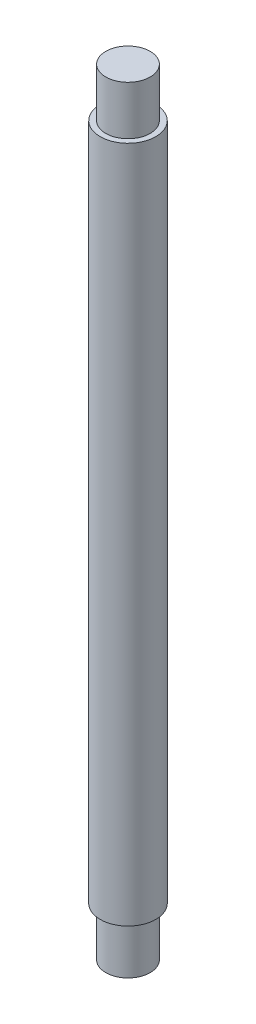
ISO-10303-21;
HEADER;
FILE_DESCRIPTION(('STEP AP214'),'2;1');
FILE_NAME('part.step','',(''),(''),'','','');
FILE_SCHEMA(('AUTOMOTIVE_DESIGN { 1 0 10303 214 1 1 1 1 }'));
ENDSEC;
DATA;
#1=APPLICATION_CONTEXT('core data for automotive mechanical design processes');
#2=APPLICATION_PROTOCOL_DEFINITION('international standard','automotive_design',2000,#1);
#3=PRODUCT_CONTEXT('',#1,'mechanical');
#4=PRODUCT('Part','Part','',(#3));
#5=PRODUCT_RELATED_PRODUCT_CATEGORY('part','',(#4));
#6=PRODUCT_DEFINITION_FORMATION('','',#4);
#7=PRODUCT_DEFINITION_CONTEXT('part definition',#1,'design');
#8=PRODUCT_DEFINITION('design','',#6,#7);
#9=PRODUCT_DEFINITION_SHAPE('','',#8);
#10=(LENGTH_UNIT() NAMED_UNIT(*) SI_UNIT(.MILLI.,.METRE.));
#11=(NAMED_UNIT(*) PLANE_ANGLE_UNIT() SI_UNIT($,.RADIAN.));
#12=(NAMED_UNIT(*) SI_UNIT($,.STERADIAN.) SOLID_ANGLE_UNIT());
#13=UNCERTAINTY_MEASURE_WITH_UNIT(LENGTH_MEASURE(1.E-05),#10,'distance_accuracy_value','');
#14=(GEOMETRIC_REPRESENTATION_CONTEXT(3) GLOBAL_UNCERTAINTY_ASSIGNED_CONTEXT((#13)) GLOBAL_UNIT_ASSIGNED_CONTEXT((#10,
#11,#12)) REPRESENTATION_CONTEXT('',''));
#15=CARTESIAN_POINT('',(0.,0.,0.));
#16=DIRECTION('',(0.,0.,1.));
#17=DIRECTION('',(1.,0.,0.));
#18=AXIS2_PLACEMENT_3D('',#15,#16,#17);
#19=CARTESIAN_POINT('',(0.,0.,0.));
#20=DIRECTION('',(0.,1.,0.));
#21=DIRECTION('',(0.,0.,1.));
#22=AXIS2_PLACEMENT_3D('',#19,#20,#21);
#23=PLANE('',#22);
#24=CARTESIAN_POINT('',(0.,0.,0.));
#25=DIRECTION('',(0.,1.,0.));
#26=DIRECTION('',(0.,0.,1.));
#27=AXIS2_PLACEMENT_3D('',#24,#25,#26);
#28=CIRCLE('',#27,2.54);
#29=CARTESIAN_POINT('',(0.,0.,2.54));
#30=VERTEX_POINT('',#29);
#31=EDGE_CURVE('E18',#30,#30,#28,.T.);
#32=ORIENTED_EDGE('',*,*,#31,.F.);
#33=EDGE_LOOP('',(#32));
#34=FACE_BOUND('',#33,.T.);
#35=ADVANCED_FACE('F15',(#34),#23,.F.);
#36=CARTESIAN_POINT('',(0.,88.646,0.));
#37=DIRECTION('',(0.,1.,0.));
#38=DIRECTION('',(0.,0.,1.));
#39=AXIS2_PLACEMENT_3D('',#36,#37,#38);
#40=PLANE('',#39);
#41=CARTESIAN_POINT('',(0.,88.646,0.));
#42=DIRECTION('',(0.,1.,0.));
#43=DIRECTION('',(0.,0.,1.));
#44=AXIS2_PLACEMENT_3D('',#41,#42,#43);
#45=CIRCLE('',#44,2.54);
#46=CARTESIAN_POINT('',(0.,88.646,2.54));
#47=VERTEX_POINT('',#46);
#48=EDGE_CURVE('E34',#47,#47,#45,.F.);
#49=ORIENTED_EDGE('',*,*,#48,.F.);
#50=EDGE_LOOP('',(#49));
#51=FACE_BOUND('',#50,.T.);
#52=ADVANCED_FACE('F45',(#51),#40,.T.);
#53=CARTESIAN_POINT('',(0.,0.,0.));
#54=DIRECTION('',(0.,1.,0.));
#55=DIRECTION('',(0.,0.,1.));
#56=AXIS2_PLACEMENT_3D('',#53,#54,#55);
#57=CYLINDRICAL_SURFACE('',#56,2.54);
#58=ORIENTED_EDGE('',*,*,#31,.T.);
#59=EDGE_LOOP('',(#58));
#60=FACE_BOUND('',#59,.T.);
#61=CARTESIAN_POINT('',(0.,5.588,0.));
#62=DIRECTION('',(0.,1.,0.));
#63=DIRECTION('',(0.,0.,1.));
#64=AXIS2_PLACEMENT_3D('',#61,#62,#63);
#65=CIRCLE('',#64,2.54);
#66=CARTESIAN_POINT('',(0.,5.588,2.54));
#67=VERTEX_POINT('',#66);
#68=EDGE_CURVE('E32',#67,#67,#65,.F.);
#69=ORIENTED_EDGE('',*,*,#68,.T.);
#70=EDGE_LOOP('',(#69));
#71=FACE_BOUND('',#70,.T.);
#72=ADVANCED_FACE('F41',(#60,#71),#57,.T.);
#73=CARTESIAN_POINT('',(0.,0.,0.));
#74=DIRECTION('',(0.,1.,0.));
#75=DIRECTION('',(0.,0.,1.));
#76=AXIS2_PLACEMENT_3D('',#73,#74,#75);
#77=CYLINDRICAL_SURFACE('',#76,2.54);
#78=ORIENTED_EDGE('',*,*,#48,.T.);
#79=EDGE_LOOP('',(#78));
#80=FACE_BOUND('',#79,.T.);
#81=CARTESIAN_POINT('',(0.,83.058,0.));
#82=DIRECTION('',(0.,1.,0.));
#83=DIRECTION('',(0.,0.,1.));
#84=AXIS2_PLACEMENT_3D('',#81,#82,#83);
#85=CIRCLE('',#84,2.54);
#86=CARTESIAN_POINT('',(0.,83.058,2.54));
#87=VERTEX_POINT('',#86);
#88=EDGE_CURVE('E27',#87,#87,#85,.F.);
#89=ORIENTED_EDGE('',*,*,#88,.F.);
#90=EDGE_LOOP('',(#89));
#91=FACE_BOUND('',#90,.T.);
#92=ADVANCED_FACE('F65',(#80,#91),#77,.T.);
#93=CARTESIAN_POINT('',(0.,5.588,0.));
#94=DIRECTION('',(0.,1.,0.));
#95=DIRECTION('',(0.,0.,1.));
#96=AXIS2_PLACEMENT_3D('',#93,#94,#95);
#97=PLANE('',#96);
#98=ORIENTED_EDGE('',*,*,#68,.F.);
#99=EDGE_LOOP('',(#98));
#100=FACE_BOUND('',#99,.T.);
#101=CARTESIAN_POINT('',(0.,5.588,0.));
#102=DIRECTION('',(0.,1.,0.));
#103=DIRECTION('',(0.,0.,1.));
#104=AXIS2_PLACEMENT_3D('',#101,#102,#103);
#105=CIRCLE('',#104,3.175);
#106=CARTESIAN_POINT('',(0.,5.588,3.175));
#107=VERTEX_POINT('',#106);
#108=EDGE_CURVE('E22',#107,#107,#105,.T.);
#109=ORIENTED_EDGE('',*,*,#108,.F.);
#110=EDGE_LOOP('',(#109));
#111=FACE_BOUND('',#110,.T.);
#112=ADVANCED_FACE('F59',(#100,#111),#97,.F.);
#113=CARTESIAN_POINT('',(0.,83.058,0.));
#114=DIRECTION('',(0.,1.,0.));
#115=DIRECTION('',(0.,0.,1.));
#116=AXIS2_PLACEMENT_3D('',#113,#114,#115);
#117=PLANE('',#116);
#118=ORIENTED_EDGE('',*,*,#88,.T.);
#119=EDGE_LOOP('',(#118));
#120=FACE_BOUND('',#119,.T.);
#121=CARTESIAN_POINT('',(0.,83.058,0.));
#122=DIRECTION('',(0.,1.,0.));
#123=DIRECTION('',(0.,0.,1.));
#124=AXIS2_PLACEMENT_3D('',#121,#122,#123);
#125=CIRCLE('',#124,3.175);
#126=CARTESIAN_POINT('',(0.,83.058,3.175));
#127=VERTEX_POINT('',#126);
#128=EDGE_CURVE('E10',#127,#127,#125,.F.);
#129=ORIENTED_EDGE('',*,*,#128,.F.);
#130=EDGE_LOOP('',(#129));
#131=FACE_BOUND('',#130,.T.);
#132=ADVANCED_FACE('F53',(#120,#131),#117,.T.);
#133=CARTESIAN_POINT('',(0.,83.058,0.));
#134=DIRECTION('',(0.,1.,0.));
#135=DIRECTION('',(0.,0.,1.));
#136=AXIS2_PLACEMENT_3D('',#133,#134,#135);
#137=CYLINDRICAL_SURFACE('',#136,3.175);
#138=ORIENTED_EDGE('',*,*,#108,.T.);
#139=EDGE_LOOP('',(#138));
#140=FACE_BOUND('',#139,.T.);
#141=ORIENTED_EDGE('',*,*,#128,.T.);
#142=EDGE_LOOP('',(#141));
#143=FACE_BOUND('',#142,.T.);
#144=ADVANCED_FACE('F51',(#140,#143),#137,.T.);
#145=CLOSED_SHELL('',(#35,#52,#72,#92,#112,#132,#144));
#146=MANIFOLD_SOLID_BREP('B1',#145);
#147=ADVANCED_BREP_SHAPE_REPRESENTATION('',(#18,#146),#14);
#148=SHAPE_DEFINITION_REPRESENTATION(#9,#147);
ENDSEC;
END-ISO-10303-21;
